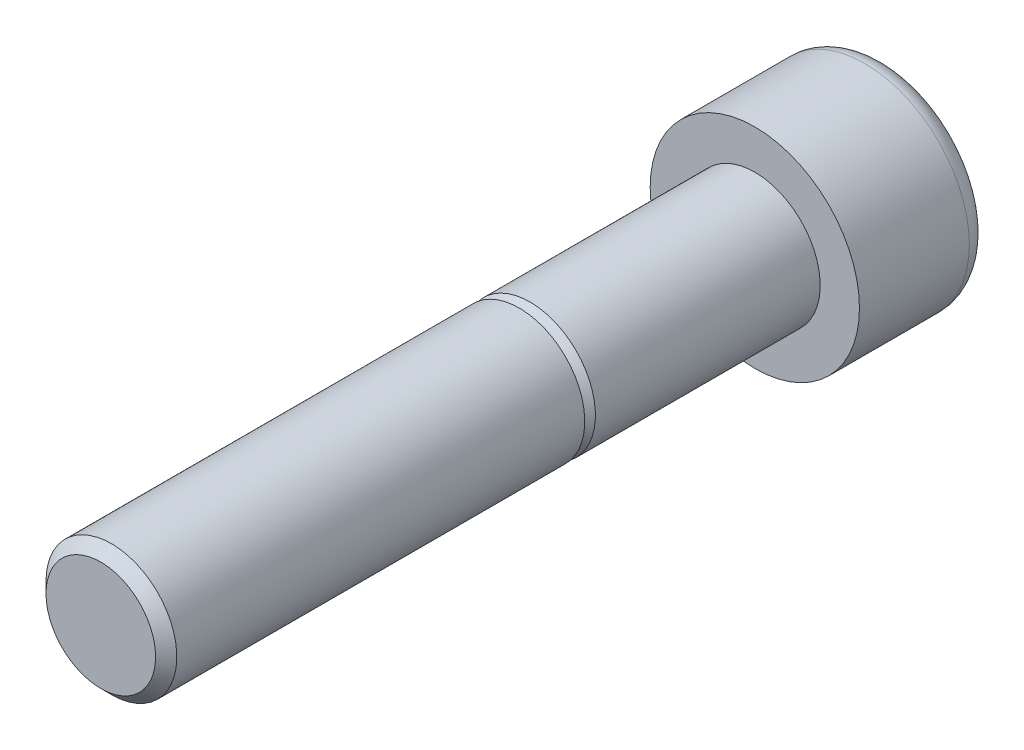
ISO-10303-21;
HEADER;
FILE_DESCRIPTION(('STEP AP214'),'2;1');
FILE_NAME('part.step','',(''),(''),'','','');
FILE_SCHEMA(('AUTOMOTIVE_DESIGN { 1 0 10303 214 1 1 1 1 }'));
ENDSEC;
DATA;
#1=APPLICATION_CONTEXT('core data for automotive mechanical design processes');
#2=APPLICATION_PROTOCOL_DEFINITION('international standard','automotive_design',2000,#1);
#3=PRODUCT_CONTEXT('',#1,'mechanical');
#4=PRODUCT('Part','Part','',(#3));
#5=PRODUCT_RELATED_PRODUCT_CATEGORY('part','',(#4));
#6=PRODUCT_DEFINITION_FORMATION('','',#4);
#7=PRODUCT_DEFINITION_CONTEXT('part definition',#1,'design');
#8=PRODUCT_DEFINITION('design','',#6,#7);
#9=PRODUCT_DEFINITION_SHAPE('','',#8);
#10=(LENGTH_UNIT() NAMED_UNIT(*) SI_UNIT(.MILLI.,.METRE.));
#11=(NAMED_UNIT(*) PLANE_ANGLE_UNIT() SI_UNIT($,.RADIAN.));
#12=(NAMED_UNIT(*) SI_UNIT($,.STERADIAN.) SOLID_ANGLE_UNIT());
#13=UNCERTAINTY_MEASURE_WITH_UNIT(LENGTH_MEASURE(1.E-05),#10,'distance_accuracy_value','');
#14=(GEOMETRIC_REPRESENTATION_CONTEXT(3) GLOBAL_UNCERTAINTY_ASSIGNED_CONTEXT((#13)) GLOBAL_UNIT_ASSIGNED_CONTEXT((#10,
#11,#12)) REPRESENTATION_CONTEXT('',''));
#15=CARTESIAN_POINT('',(0.,0.,0.));
#16=DIRECTION('',(0.,0.,1.));
#17=DIRECTION('',(1.,0.,0.));
#18=AXIS2_PLACEMENT_3D('',#15,#16,#17);
#19=CARTESIAN_POINT('',(0.,0.,0.));
#20=DIRECTION('',(0.,0.,-1.));
#21=DIRECTION('',(-1.,0.,0.));
#22=AXIS2_PLACEMENT_3D('',#19,#20,#21);
#23=PLANE('',#22);
#24=CARTESIAN_POINT('',(0.,0.,0.));
#25=DIRECTION('',(0.,0.,-1.));
#26=DIRECTION('',(-1.,0.,0.));
#27=AXIS2_PLACEMENT_3D('',#24,#25,#26);
#28=CIRCLE('',#27,8.);
#29=CARTESIAN_POINT('',(-8.,0.,0.));
#30=VERTEX_POINT('',#29);
#31=EDGE_CURVE('E107',#30,#30,#28,.T.);
#32=ORIENTED_EDGE('',*,*,#31,.F.);
#33=EDGE_LOOP('',(#32));
#34=FACE_BOUND('',#33,.T.);
#35=CARTESIAN_POINT('',(0.,0.,0.));
#36=DIRECTION('',(0.,0.,-1.));
#37=DIRECTION('',(-1.,0.,0.));
#38=AXIS2_PLACEMENT_3D('',#35,#36,#37);
#39=CIRCLE('',#38,5.);
#40=CARTESIAN_POINT('',(-5.,0.,0.));
#41=VERTEX_POINT('',#40);
#42=EDGE_CURVE('E9',#41,#41,#39,.F.);
#43=ORIENTED_EDGE('',*,*,#42,.F.);
#44=EDGE_LOOP('',(#43));
#45=FACE_BOUND('',#44,.T.);
#46=ADVANCED_FACE('F14',(#34,#45),#23,.F.);
#47=CARTESIAN_POINT('',(0.,6.4,-10.));
#48=DIRECTION('',(0.,0.,1.));
#49=DIRECTION('',(1.,0.,0.));
#50=AXIS2_PLACEMENT_3D('',#47,#48,#49);
#51=PLANE('',#50);
#52=CARTESIAN_POINT('',(0.,0.,-10.));
#53=DIRECTION('',(0.,0.,-1.));
#54=DIRECTION('',(-1.,0.,0.));
#55=AXIS2_PLACEMENT_3D('',#52,#53,#54);
#56=CIRCLE('',#55,6.4);
#57=CARTESIAN_POINT('',(-6.4,0.,-10.));
#58=VERTEX_POINT('',#57);
#59=EDGE_CURVE('E89',#58,#58,#56,.T.);
#60=ORIENTED_EDGE('',*,*,#59,.T.);
#61=EDGE_LOOP('',(#60));
#62=FACE_BOUND('',#61,.T.);
#63=DIRECTION('',(-0.866025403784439,0.5,0.));
#64=VECTOR('',#63,1.);
#65=CARTESIAN_POINT('',(-4.77128129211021,-1.86410161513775,-10.));
#66=LINE('',#65,#64);
#67=CARTESIAN_POINT('',(0.,-4.61880215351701,-10.));
#68=VERTEX_POINT('',#67);
#69=CARTESIAN_POINT('',(-4.,-2.3094010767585,-10.));
#70=VERTEX_POINT('',#69);
#71=EDGE_CURVE('E23',#68,#70,#66,.T.);
#72=ORIENTED_EDGE('',*,*,#71,.F.);
#73=DIRECTION('',(-0.866025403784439,-0.5,0.));
#74=VECTOR('',#73,1.);
#75=CARTESIAN_POINT('',(4.7712812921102,-1.86410161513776,-10.));
#76=LINE('',#75,#74);
#77=CARTESIAN_POINT('',(4.,-2.30940107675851,-10.));
#78=VERTEX_POINT('',#77);
#79=EDGE_CURVE('E38',#78,#68,#76,.T.);
#80=ORIENTED_EDGE('',*,*,#79,.F.);
#81=DIRECTION('',(0.,-1.,0.));
#82=VECTOR('',#81,1.);
#83=CARTESIAN_POINT('',(4.,6.4,-10.));
#84=LINE('',#83,#82);
#85=CARTESIAN_POINT('',(4.,2.3094010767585,-10.));
#86=VERTEX_POINT('',#85);
#87=EDGE_CURVE('E120',#86,#78,#84,.T.);
#88=ORIENTED_EDGE('',*,*,#87,.F.);
#89=DIRECTION('',(0.866025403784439,-0.5,0.));
#90=VECTOR('',#89,1.);
#91=CARTESIAN_POINT('',(-0.771281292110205,5.06410161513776,-10.));
#92=LINE('',#91,#90);
#93=CARTESIAN_POINT('',(0.,4.61880215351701,-10.));
#94=VERTEX_POINT('',#93);
#95=EDGE_CURVE('E117',#94,#86,#92,.T.);
#96=ORIENTED_EDGE('',*,*,#95,.F.);
#97=DIRECTION('',(0.866025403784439,0.5,0.));
#98=VECTOR('',#97,1.);
#99=CARTESIAN_POINT('',(0.771281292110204,5.06410161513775,-10.));
#100=LINE('',#99,#98);
#101=CARTESIAN_POINT('',(-4.,2.30940107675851,-10.));
#102=VERTEX_POINT('',#101);
#103=EDGE_CURVE('E114',#102,#94,#100,.T.);
#104=ORIENTED_EDGE('',*,*,#103,.F.);
#105=DIRECTION('',(0.,1.,0.));
#106=VECTOR('',#105,1.);
#107=CARTESIAN_POINT('',(-4.,6.4,-10.));
#108=LINE('',#107,#106);
#109=EDGE_CURVE('E111',#70,#102,#108,.T.);
#110=ORIENTED_EDGE('',*,*,#109,.F.);
#111=EDGE_LOOP('',(#72,#80,#88,#96,#104,#110));
#112=FACE_BOUND('',#111,.T.);
#113=ADVANCED_FACE('F16',(#62,#112),#51,.F.);
#114=CARTESIAN_POINT('',(0.,0.,-10.));
#115=DIRECTION('',(0.,0.,-1.));
#116=DIRECTION('',(-1.,0.,0.));
#117=AXIS2_PLACEMENT_3D('',#114,#115,#116);
#118=CYLINDRICAL_SURFACE('',#117,8.);
#119=CARTESIAN_POINT('',(0.,0.,-8.4));
#120=DIRECTION('',(0.,0.,-1.));
#121=DIRECTION('',(-1.,0.,0.));
#122=AXIS2_PLACEMENT_3D('',#119,#120,#121);
#123=CIRCLE('',#122,8.);
#124=CARTESIAN_POINT('',(-8.,0.,-8.4));
#125=VERTEX_POINT('',#124);
#126=EDGE_CURVE('E97',#125,#125,#123,.T.);
#127=ORIENTED_EDGE('',*,*,#126,.F.);
#128=EDGE_LOOP('',(#127));
#129=FACE_BOUND('',#128,.T.);
#130=ORIENTED_EDGE('',*,*,#31,.T.);
#131=EDGE_LOOP('',(#130));
#132=FACE_BOUND('',#131,.T.);
#133=ADVANCED_FACE('F236',(#129,#132),#118,.T.);
#134=CARTESIAN_POINT('',(0.,0.,-8.4));
#135=DIRECTION('',(0.,0.,-1.));
#136=DIRECTION('',(-1.,0.,0.));
#137=AXIS2_PLACEMENT_3D('',#134,#135,#136);
#138=TOROIDAL_SURFACE('',#137,6.4,1.6);
#139=ORIENTED_EDGE('',*,*,#59,.F.);
#140=EDGE_LOOP('',(#139));
#141=FACE_BOUND('',#140,.T.);
#142=ORIENTED_EDGE('',*,*,#126,.T.);
#143=EDGE_LOOP('',(#142));
#144=FACE_BOUND('',#143,.T.);
#145=ADVANCED_FACE('F243',(#141,#144),#138,.T.);
#146=CARTESIAN_POINT('',(-4.,-2.3094010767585,-5.));
#147=DIRECTION('',(0.5,0.866025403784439,0.));
#148=DIRECTION('',(-0.866025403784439,0.5,0.));
#149=AXIS2_PLACEMENT_3D('',#146,#147,#148);
#150=PLANE('',#149);
#151=ORIENTED_EDGE('',*,*,#71,.T.);
#152=DIRECTION('',(0.,0.,-1.));
#153=VECTOR('',#152,1.);
#154=CARTESIAN_POINT('',(-4.,-2.3094010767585,-5.));
#155=LINE('',#154,#153);
#156=CARTESIAN_POINT('',(-4.,-2.3094010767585,-5.));
#157=VERTEX_POINT('',#156);
#158=EDGE_CURVE('E30',#157,#70,#155,.T.);
#159=ORIENTED_EDGE('',*,*,#158,.F.);
#160=DIRECTION('',(0.866025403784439,-0.5,0.));
#161=VECTOR('',#160,1.);
#162=CARTESIAN_POINT('',(-4.,-2.3094010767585,-5.));
#163=LINE('',#162,#161);
#164=CARTESIAN_POINT('',(0.,-4.61880215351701,-5.));
#165=VERTEX_POINT('',#164);
#166=EDGE_CURVE('E74',#157,#165,#163,.T.);
#167=ORIENTED_EDGE('',*,*,#166,.T.);
#168=DIRECTION('',(0.,0.,-1.));
#169=VECTOR('',#168,1.);
#170=CARTESIAN_POINT('',(0.,-4.61880215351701,-5.));
#171=LINE('',#170,#169);
#172=EDGE_CURVE('E82',#165,#68,#171,.T.);
#173=ORIENTED_EDGE('',*,*,#172,.T.);
#174=EDGE_LOOP('',(#151,#159,#167,#173));
#175=FACE_BOUND('',#174,.T.);
#176=ADVANCED_FACE('F81',(#175),#150,.T.);
#177=CARTESIAN_POINT('',(0.,-4.61880215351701,-5.));
#178=DIRECTION('',(-0.5,0.866025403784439,0.));
#179=DIRECTION('',(-0.866025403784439,-0.5,0.));
#180=AXIS2_PLACEMENT_3D('',#177,#178,#179);
#181=PLANE('',#180);
#182=ORIENTED_EDGE('',*,*,#79,.T.);
#183=ORIENTED_EDGE('',*,*,#172,.F.);
#184=DIRECTION('',(0.866025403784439,0.5,0.));
#185=VECTOR('',#184,1.);
#186=CARTESIAN_POINT('',(0.,-4.61880215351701,-5.));
#187=LINE('',#186,#185);
#188=CARTESIAN_POINT('',(4.,-2.30940107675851,-5.));
#189=VERTEX_POINT('',#188);
#190=EDGE_CURVE('E70',#165,#189,#187,.T.);
#191=ORIENTED_EDGE('',*,*,#190,.T.);
#192=DIRECTION('',(0.,0.,-1.));
#193=VECTOR('',#192,1.);
#194=CARTESIAN_POINT('',(4.,-2.30940107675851,-5.));
#195=LINE('',#194,#193);
#196=EDGE_CURVE('E90',#189,#78,#195,.T.);
#197=ORIENTED_EDGE('',*,*,#196,.T.);
#198=EDGE_LOOP('',(#182,#183,#191,#197));
#199=FACE_BOUND('',#198,.T.);
#200=ADVANCED_FACE('F87',(#199),#181,.T.);
#201=CARTESIAN_POINT('',(4.,-2.30940107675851,-5.));
#202=DIRECTION('',(-1.,0.,0.));
#203=DIRECTION('',(0.,-1.,0.));
#204=AXIS2_PLACEMENT_3D('',#201,#202,#203);
#205=PLANE('',#204);
#206=ORIENTED_EDGE('',*,*,#87,.T.);
#207=ORIENTED_EDGE('',*,*,#196,.F.);
#208=DIRECTION('',(0.,1.,0.));
#209=VECTOR('',#208,1.);
#210=CARTESIAN_POINT('',(4.,-2.30940107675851,-5.));
#211=LINE('',#210,#209);
#212=CARTESIAN_POINT('',(4.,2.3094010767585,-5.));
#213=VERTEX_POINT('',#212);
#214=EDGE_CURVE('E76',#189,#213,#211,.T.);
#215=ORIENTED_EDGE('',*,*,#214,.T.);
#216=DIRECTION('',(0.,0.,-1.));
#217=VECTOR('',#216,1.);
#218=CARTESIAN_POINT('',(4.,2.3094010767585,-5.));
#219=LINE('',#218,#217);
#220=EDGE_CURVE('E100',#213,#86,#219,.T.);
#221=ORIENTED_EDGE('',*,*,#220,.T.);
#222=EDGE_LOOP('',(#206,#207,#215,#221));
#223=FACE_BOUND('',#222,.T.);
#224=ADVANCED_FACE('F159',(#223),#205,.T.);
#225=CARTESIAN_POINT('',(4.,2.3094010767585,-5.));
#226=DIRECTION('',(-0.5,-0.866025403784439,0.));
#227=DIRECTION('',(0.866025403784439,-0.5,0.));
#228=AXIS2_PLACEMENT_3D('',#225,#226,#227);
#229=PLANE('',#228);
#230=ORIENTED_EDGE('',*,*,#95,.T.);
#231=ORIENTED_EDGE('',*,*,#220,.F.);
#232=DIRECTION('',(-0.866025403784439,0.5,0.));
#233=VECTOR('',#232,1.);
#234=CARTESIAN_POINT('',(4.,2.3094010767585,-5.));
#235=LINE('',#234,#233);
#236=CARTESIAN_POINT('',(0.,4.61880215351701,-5.));
#237=VERTEX_POINT('',#236);
#238=EDGE_CURVE('E162',#213,#237,#235,.T.);
#239=ORIENTED_EDGE('',*,*,#238,.T.);
#240=DIRECTION('',(0.,0.,-1.));
#241=VECTOR('',#240,1.);
#242=CARTESIAN_POINT('',(0.,4.61880215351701,-5.));
#243=LINE('',#242,#241);
#244=EDGE_CURVE('E141',#237,#94,#243,.T.);
#245=ORIENTED_EDGE('',*,*,#244,.T.);
#246=EDGE_LOOP('',(#230,#231,#239,#245));
#247=FACE_BOUND('',#246,.T.);
#248=ADVANCED_FACE('F161',(#247),#229,.T.);
#249=CARTESIAN_POINT('',(0.,4.61880215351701,-5.));
#250=DIRECTION('',(0.5,-0.866025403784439,0.));
#251=DIRECTION('',(0.866025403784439,0.5,0.));
#252=AXIS2_PLACEMENT_3D('',#249,#250,#251);
#253=PLANE('',#252);
#254=ORIENTED_EDGE('',*,*,#103,.T.);
#255=ORIENTED_EDGE('',*,*,#244,.F.);
#256=DIRECTION('',(-0.866025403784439,-0.5,0.));
#257=VECTOR('',#256,1.);
#258=CARTESIAN_POINT('',(0.,4.61880215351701,-5.));
#259=LINE('',#258,#257);
#260=CARTESIAN_POINT('',(-4.,2.30940107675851,-5.));
#261=VERTEX_POINT('',#260);
#262=EDGE_CURVE('E139',#237,#261,#259,.T.);
#263=ORIENTED_EDGE('',*,*,#262,.T.);
#264=DIRECTION('',(0.,0.,-1.));
#265=VECTOR('',#264,1.);
#266=CARTESIAN_POINT('',(-4.,2.30940107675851,-5.));
#267=LINE('',#266,#265);
#268=EDGE_CURVE('E133',#261,#102,#267,.T.);
#269=ORIENTED_EDGE('',*,*,#268,.T.);
#270=EDGE_LOOP('',(#254,#255,#263,#269));
#271=FACE_BOUND('',#270,.T.);
#272=ADVANCED_FACE('F135',(#271),#253,.T.);
#273=CARTESIAN_POINT('',(-4.,2.30940107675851,-5.));
#274=DIRECTION('',(1.,0.,0.));
#275=DIRECTION('',(0.,1.,0.));
#276=AXIS2_PLACEMENT_3D('',#273,#274,#275);
#277=PLANE('',#276);
#278=ORIENTED_EDGE('',*,*,#109,.T.);
#279=ORIENTED_EDGE('',*,*,#268,.F.);
#280=DIRECTION('',(0.,-1.,0.));
#281=VECTOR('',#280,1.);
#282=CARTESIAN_POINT('',(-4.,2.30940107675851,-5.));
#283=LINE('',#282,#281);
#284=EDGE_CURVE('E149',#261,#157,#283,.T.);
#285=ORIENTED_EDGE('',*,*,#284,.T.);
#286=ORIENTED_EDGE('',*,*,#158,.T.);
#287=EDGE_LOOP('',(#278,#279,#285,#286));
#288=FACE_BOUND('',#287,.T.);
#289=ADVANCED_FACE('F132',(#288),#277,.T.);
#290=CARTESIAN_POINT('',(0.,-4.61880215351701,-5.));
#291=DIRECTION('',(0.,0.,1.));
#292=DIRECTION('',(-1.,0.,0.));
#293=AXIS2_PLACEMENT_3D('',#290,#291,#292);
#294=PLANE('',#293);
#295=ORIENTED_EDGE('',*,*,#166,.F.);
#296=ORIENTED_EDGE('',*,*,#284,.F.);
#297=ORIENTED_EDGE('',*,*,#262,.F.);
#298=ORIENTED_EDGE('',*,*,#238,.F.);
#299=ORIENTED_EDGE('',*,*,#214,.F.);
#300=ORIENTED_EDGE('',*,*,#190,.F.);
#301=EDGE_LOOP('',(#295,#296,#297,#298,#299,#300));
#302=FACE_BOUND('',#301,.T.);
#303=ADVANCED_FACE('F72',(#302),#294,.F.);
#304=CARTESIAN_POINT('',(0.,0.,0.));
#305=DIRECTION('',(0.,0.,-1.));
#306=DIRECTION('',(-1.,0.,0.));
#307=AXIS2_PLACEMENT_3D('',#304,#305,#306);
#308=CYLINDRICAL_SURFACE('',#307,5.);
#309=CARTESIAN_POINT('',(0.,0.,17.1882131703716));
#310=DIRECTION('',(0.,0.,-1.));
#311=DIRECTION('',(-1.,0.,0.));
#312=AXIS2_PLACEMENT_3D('',#309,#310,#311);
#313=CIRCLE('',#312,5.);
#314=CARTESIAN_POINT('',(-5.,0.,17.1882131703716));
#315=VERTEX_POINT('',#314);
#316=EDGE_CURVE('E187',#315,#315,#313,.T.);
#317=ORIENTED_EDGE('',*,*,#316,.T.);
#318=EDGE_LOOP('',(#317));
#319=FACE_BOUND('',#318,.T.);
#320=ORIENTED_EDGE('',*,*,#42,.T.);
#321=EDGE_LOOP('',(#320));
#322=FACE_BOUND('',#321,.T.);
#323=ADVANCED_FACE('F195',(#319,#322),#308,.T.);
#324=CARTESIAN_POINT('',(0.,0.,50.));
#325=DIRECTION('',(0.,0.,-1.));
#326=DIRECTION('',(-1.,0.,0.));
#327=AXIS2_PLACEMENT_3D('',#324,#325,#326);
#328=PLANE('',#327);
#329=CARTESIAN_POINT('',(0.,0.,50.));
#330=DIRECTION('',(0.,0.,-1.));
#331=DIRECTION('',(-1.,0.,0.));
#332=AXIS2_PLACEMENT_3D('',#329,#330,#331);
#333=CIRCLE('',#332,4.18821317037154);
#334=CARTESIAN_POINT('',(-4.18821317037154,0.,50.));
#335=VERTEX_POINT('',#334);
#336=EDGE_CURVE('E85',#335,#335,#333,.T.);
#337=ORIENTED_EDGE('',*,*,#336,.F.);
#338=EDGE_LOOP('',(#337));
#339=FACE_BOUND('',#338,.T.);
#340=ADVANCED_FACE('F219',(#339),#328,.F.);
#341=CARTESIAN_POINT('',(0.,0.,50.));
#342=DIRECTION('',(0.,0.,-1.));
#343=DIRECTION('',(-1.,0.,0.));
#344=AXIS2_PLACEMENT_3D('',#341,#342,#343);
#345=CONICAL_SURFACE('',#344,4.18821317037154,0.78539816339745);
#346=CARTESIAN_POINT('',(0.,0.,49.1882131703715));
#347=DIRECTION('',(0.,0.,-1.));
#348=DIRECTION('',(-1.,0.,0.));
#349=AXIS2_PLACEMENT_3D('',#346,#347,#348);
#350=CIRCLE('',#349,5.);
#351=CARTESIAN_POINT('',(-5.,0.,49.1882131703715));
#352=VERTEX_POINT('',#351);
#353=EDGE_CURVE('E175',#352,#352,#350,.T.);
#354=ORIENTED_EDGE('',*,*,#353,.F.);
#355=EDGE_LOOP('',(#354));
#356=FACE_BOUND('',#355,.T.);
#357=ORIENTED_EDGE('',*,*,#336,.T.);
#358=EDGE_LOOP('',(#357));
#359=FACE_BOUND('',#358,.T.);
#360=ADVANCED_FACE('F213',(#356,#359),#345,.T.);
#361=CARTESIAN_POINT('',(0.,0.,0.));
#362=DIRECTION('',(0.,0.,-1.));
#363=DIRECTION('',(-1.,0.,0.));
#364=AXIS2_PLACEMENT_3D('',#361,#362,#363);
#365=CYLINDRICAL_SURFACE('',#364,5.);
#366=CARTESIAN_POINT('',(0.,0.,18.));
#367=DIRECTION('',(0.,0.,-1.));
#368=DIRECTION('',(-1.,0.,0.));
#369=AXIS2_PLACEMENT_3D('',#366,#367,#368);
#370=CIRCLE('',#369,5.);
#371=CARTESIAN_POINT('',(-5.,0.,18.));
#372=VERTEX_POINT('',#371);
#373=EDGE_CURVE('E179',#372,#372,#370,.T.);
#374=ORIENTED_EDGE('',*,*,#373,.F.);
#375=EDGE_LOOP('',(#374));
#376=FACE_BOUND('',#375,.T.);
#377=ORIENTED_EDGE('',*,*,#353,.T.);
#378=EDGE_LOOP('',(#377));
#379=FACE_BOUND('',#378,.T.);
#380=ADVANCED_FACE('F207',(#376,#379),#365,.T.);
#381=CARTESIAN_POINT('',(0.,5.,18.));
#382=DIRECTION('',(0.,0.,1.));
#383=DIRECTION('',(1.,0.,0.));
#384=AXIS2_PLACEMENT_3D('',#381,#382,#383);
#385=PLANE('',#384);
#386=CARTESIAN_POINT('',(0.,0.,18.));
#387=DIRECTION('',(0.,0.,-1.));
#388=DIRECTION('',(-1.,0.,0.));
#389=AXIS2_PLACEMENT_3D('',#386,#387,#388);
#390=CIRCLE('',#389,4.18821317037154);
#391=CARTESIAN_POINT('',(-4.18821317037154,0.,18.));
#392=VERTEX_POINT('',#391);
#393=EDGE_CURVE('E183',#392,#392,#390,.T.);
#394=ORIENTED_EDGE('',*,*,#393,.F.);
#395=EDGE_LOOP('',(#394));
#396=FACE_BOUND('',#395,.T.);
#397=ORIENTED_EDGE('',*,*,#373,.T.);
#398=EDGE_LOOP('',(#397));
#399=FACE_BOUND('',#398,.T.);
#400=ADVANCED_FACE('F201',(#396,#399),#385,.F.);
#401=CARTESIAN_POINT('',(0.,0.,18.));
#402=DIRECTION('',(0.,0.,-1.));
#403=DIRECTION('',(-1.,0.,0.));
#404=AXIS2_PLACEMENT_3D('',#401,#402,#403);
#405=CONICAL_SURFACE('',#404,4.18821317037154,0.785398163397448);
#406=ORIENTED_EDGE('',*,*,#316,.F.);
#407=EDGE_LOOP('',(#406));
#408=FACE_BOUND('',#407,.T.);
#409=ORIENTED_EDGE('',*,*,#393,.T.);
#410=EDGE_LOOP('',(#409));
#411=FACE_BOUND('',#410,.T.);
#412=ADVANCED_FACE('F198',(#408,#411),#405,.T.);
#413=CLOSED_SHELL('',(#46,#113,#133,#145,#176,#200,#224,#248,#272,#289,#303,#323,#340,#360,#380,
#400,#412));
#414=MANIFOLD_SOLID_BREP('B1',#413);
#415=ADVANCED_BREP_SHAPE_REPRESENTATION('',(#18,#414),#14);
#416=SHAPE_DEFINITION_REPRESENTATION(#9,#415);
ENDSEC;
END-ISO-10303-21;
